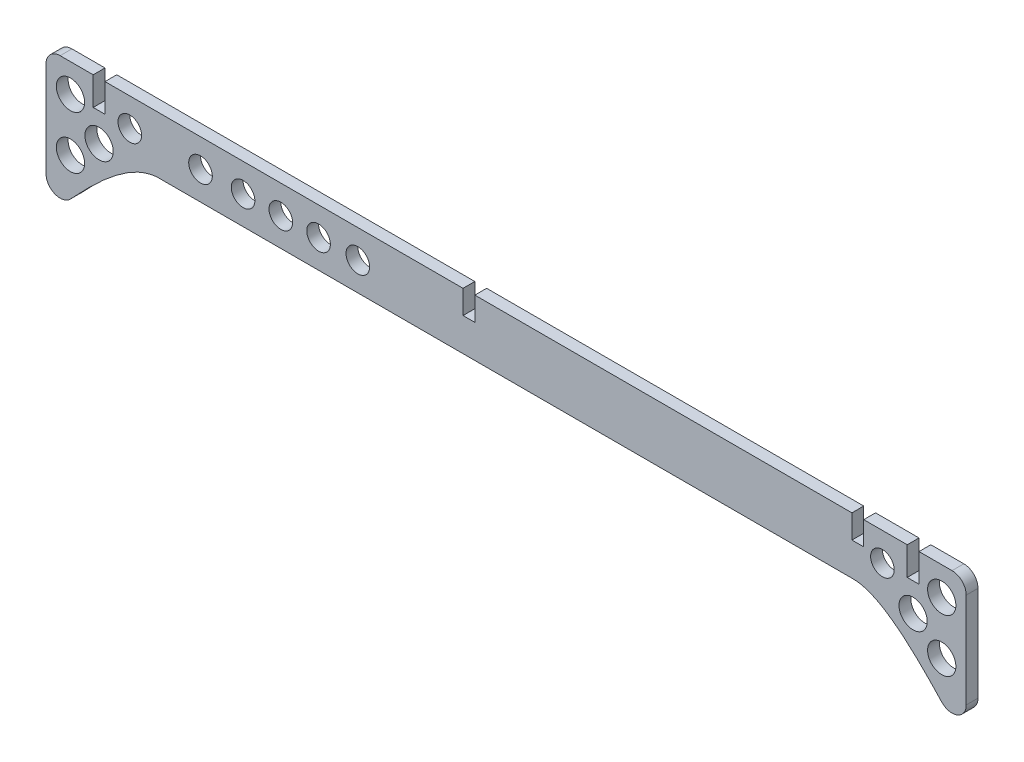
ISO-10303-21;
HEADER;
FILE_DESCRIPTION(('STEP AP214'),'2;1');
FILE_NAME('part.step','',(''),(''),'','','');
FILE_SCHEMA(('AUTOMOTIVE_DESIGN { 1 0 10303 214 1 1 1 1 }'));
ENDSEC;
DATA;
#1=APPLICATION_CONTEXT('core data for automotive mechanical design processes');
#2=APPLICATION_PROTOCOL_DEFINITION('international standard','automotive_design',2000,#1);
#3=PRODUCT_CONTEXT('',#1,'mechanical');
#4=PRODUCT('Part','Part','',(#3));
#5=PRODUCT_RELATED_PRODUCT_CATEGORY('part','',(#4));
#6=PRODUCT_DEFINITION_FORMATION('','',#4);
#7=PRODUCT_DEFINITION_CONTEXT('part definition',#1,'design');
#8=PRODUCT_DEFINITION('design','',#6,#7);
#9=PRODUCT_DEFINITION_SHAPE('','',#8);
#10=(LENGTH_UNIT() NAMED_UNIT(*) SI_UNIT(.MILLI.,.METRE.));
#11=(NAMED_UNIT(*) PLANE_ANGLE_UNIT() SI_UNIT($,.RADIAN.));
#12=(NAMED_UNIT(*) SI_UNIT($,.STERADIAN.) SOLID_ANGLE_UNIT());
#13=UNCERTAINTY_MEASURE_WITH_UNIT(LENGTH_MEASURE(1.E-05),#10,'distance_accuracy_value','');
#14=(GEOMETRIC_REPRESENTATION_CONTEXT(3) GLOBAL_UNCERTAINTY_ASSIGNED_CONTEXT((#13)) GLOBAL_UNIT_ASSIGNED_CONTEXT((#10,
#11,#12)) REPRESENTATION_CONTEXT('',''));
#15=CARTESIAN_POINT('',(0.,0.,0.));
#16=DIRECTION('',(0.,0.,1.));
#17=DIRECTION('',(1.,0.,0.));
#18=AXIS2_PLACEMENT_3D('',#15,#16,#17);
#19=CARTESIAN_POINT('',(-120.015,-21.7846997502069,3.175));
#20=DIRECTION('',(0.,0.,1.));
#21=DIRECTION('',(1.,0.,0.));
#22=AXIS2_PLACEMENT_3D('',#19,#20,#21);
#23=PLANE('',#22);
#24=CARTESIAN_POINT('',(117.239990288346,-14.2125382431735,3.175));
#25=DIRECTION('',(0.,0.,1.));
#26=DIRECTION('',(-1.,0.,0.));
#27=AXIS2_PLACEMENT_3D('',#24,#25,#26);
#28=CIRCLE('',#27,3.81);
#29=CARTESIAN_POINT('',(113.429990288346,-14.2125382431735,3.175));
#30=VERTEX_POINT('',#29);
#31=EDGE_CURVE('E485',#30,#30,#28,.T.);
#32=ORIENTED_EDGE('',*,*,#31,.F.);
#33=EDGE_LOOP('',(#32));
#34=FACE_BOUND('',#33,.T.);
#35=CARTESIAN_POINT('',(-109.5375,-7.62000000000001,3.175));
#36=DIRECTION('',(0.,0.,1.));
#37=DIRECTION('',(1.,0.,0.));
#38=AXIS2_PLACEMENT_3D('',#35,#36,#37);
#39=CIRCLE('',#38,3.81);
#40=CARTESIAN_POINT('',(-105.7275,-7.62000000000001,3.175));
#41=VERTEX_POINT('',#40);
#42=EDGE_CURVE('E473',#41,#41,#39,.T.);
#43=ORIENTED_EDGE('',*,*,#42,.F.);
#44=EDGE_LOOP('',(#43));
#45=FACE_BOUND('',#44,.T.);
#46=CARTESIAN_POINT('',(101.271287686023,-8.05059256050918E-12,3.175));
#47=DIRECTION('',(0.,0.,1.));
#48=DIRECTION('',(-1.,0.,0.));
#49=AXIS2_PLACEMENT_3D('',#46,#47,#48);
#50=CIRCLE('',#49,3.175);
#51=CARTESIAN_POINT('',(98.0962876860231,-8.05059256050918E-12,3.175));
#52=VERTEX_POINT('',#51);
#53=EDGE_CURVE('E461',#52,#52,#50,.T.);
#54=ORIENTED_EDGE('',*,*,#53,.F.);
#55=EDGE_LOOP('',(#54));
#56=FACE_BOUND('',#55,.T.);
#57=CARTESIAN_POINT('',(-50.4712876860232,-8.07539687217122E-12,3.175));
#58=DIRECTION('',(0.,0.,1.));
#59=DIRECTION('',(1.,0.,0.));
#60=AXIS2_PLACEMENT_3D('',#57,#58,#59);
#61=CIRCLE('',#60,3.175);
#62=CARTESIAN_POINT('',(-47.2962876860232,-8.07539687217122E-12,3.175));
#63=VERTEX_POINT('',#62);
#64=EDGE_CURVE('E449',#63,#63,#61,.T.);
#65=ORIENTED_EDGE('',*,*,#64,.F.);
#66=EDGE_LOOP('',(#65));
#67=FACE_BOUND('',#66,.T.);
#68=CARTESIAN_POINT('',(-70.7912876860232,-8.07539687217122E-12,3.175));
#69=DIRECTION('',(0.,0.,1.));
#70=DIRECTION('',(1.,0.,0.));
#71=AXIS2_PLACEMENT_3D('',#68,#69,#70);
#72=CIRCLE('',#71,3.175);
#73=CARTESIAN_POINT('',(-67.6162876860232,-8.07539687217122E-12,3.175));
#74=VERTEX_POINT('',#73);
#75=EDGE_CURVE('E437',#74,#74,#72,.T.);
#76=ORIENTED_EDGE('',*,*,#75,.F.);
#77=EDGE_LOOP('',(#76));
#78=FACE_BOUND('',#77,.T.);
#79=CARTESIAN_POINT('',(-101.271287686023,-8.07539687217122E-12,3.175));
#80=DIRECTION('',(0.,0.,1.));
#81=DIRECTION('',(1.,0.,0.));
#82=AXIS2_PLACEMENT_3D('',#79,#80,#81);
#83=CIRCLE('',#82,3.175);
#84=CARTESIAN_POINT('',(-98.0962876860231,-8.07539687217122E-12,3.175));
#85=VERTEX_POINT('',#84);
#86=EDGE_CURVE('E425',#85,#85,#83,.T.);
#87=ORIENTED_EDGE('',*,*,#86,.F.);
#88=EDGE_LOOP('',(#87));
#89=FACE_BOUND('',#88,.T.);
#90=DIRECTION('',(0.,-1.,0.));
#91=VECTOR('',#90,1.);
#92=CARTESIAN_POINT('',(-123.825,0.,3.175));
#93=LINE('',#92,#91);
#94=CARTESIAN_POINT('',(-123.825,3.80999999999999,3.175));
#95=VERTEX_POINT('',#94);
#96=CARTESIAN_POINT('',(-123.825,-21.7846997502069,3.175));
#97=VERTEX_POINT('',#96);
#98=EDGE_CURVE('E50',#95,#97,#93,.T.);
#99=ORIENTED_EDGE('',*,*,#98,.T.);
#100=CARTESIAN_POINT('',(-120.015,-21.7846997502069,3.175));
#101=DIRECTION('',(0.,0.,1.));
#102=DIRECTION('',(1.,0.,0.));
#103=AXIS2_PLACEMENT_3D('',#100,#101,#102);
#104=CIRCLE('',#103,3.80999999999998);
#105=CARTESIAN_POINT('',(-117.239990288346,-24.3953358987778,3.175));
#106=VERTEX_POINT('',#105);
#107=EDGE_CURVE('E148',#97,#106,#104,.T.);
#108=ORIENTED_EDGE('',*,*,#107,.T.);
#109=CARTESIAN_POINT('',(-117.239990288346,-24.3953358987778,3.175));
#110=CARTESIAN_POINT('',(-110.980979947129,-17.7422392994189,3.175));
#111=CARTESIAN_POINT('',(-101.376457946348,-7.66034233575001,3.175));
#112=CARTESIAN_POINT('',(-93.469360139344,-7.62000000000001,3.175));
#113=B_SPLINE_CURVE_WITH_KNOTS('',3,(#109,#110,#111,#112),.UNSPECIFIED.,.F.,.F.,(4,4),
(0.386367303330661,1.),.UNSPECIFIED.);
#114=CARTESIAN_POINT('',(-93.469360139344,-7.62000000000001,3.175));
#115=VERTEX_POINT('',#114);
#116=EDGE_CURVE('E372',#106,#115,#113,.T.);
#117=ORIENTED_EDGE('',*,*,#116,.T.);
#118=DIRECTION('',(1.,0.,0.));
#119=VECTOR('',#118,1.);
#120=CARTESIAN_POINT('',(93.469360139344,-7.62000000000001,3.175));
#121=LINE('',#120,#119);
#122=CARTESIAN_POINT('',(93.469360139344,-7.62000000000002,3.175));
#123=VERTEX_POINT('',#122);
#124=EDGE_CURVE('E392',#115,#123,#121,.T.);
#125=ORIENTED_EDGE('',*,*,#124,.T.);
#126=CARTESIAN_POINT('',(93.469360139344,-7.62000000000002,3.175));
#127=CARTESIAN_POINT('',(101.376457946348,-7.66034233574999,3.175));
#128=CARTESIAN_POINT('',(110.980979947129,-17.7422392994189,3.175));
#129=CARTESIAN_POINT('',(117.239990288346,-24.3953358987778,3.175));
#130=B_SPLINE_CURVE_WITH_KNOTS('',3,(#126,#127,#128,#129),.UNSPECIFIED.,.F.,.F.,(4,4),
(0.386367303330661,1.),.UNSPECIFIED.);
#131=CARTESIAN_POINT('',(117.239990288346,-24.3953358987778,3.175));
#132=VERTEX_POINT('',#131);
#133=EDGE_CURVE('E389',#123,#132,#130,.T.);
#134=ORIENTED_EDGE('',*,*,#133,.T.);
#135=CARTESIAN_POINT('',(120.015,-21.7846997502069,3.175));
#136=DIRECTION('',(0.,0.,1.));
#137=DIRECTION('',(-1.,0.,0.));
#138=AXIS2_PLACEMENT_3D('',#135,#136,#137);
#139=CIRCLE('',#138,3.80999999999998);
#140=CARTESIAN_POINT('',(123.825,-21.7846997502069,3.175));
#141=VERTEX_POINT('',#140);
#142=EDGE_CURVE('E391',#132,#141,#139,.T.);
#143=ORIENTED_EDGE('',*,*,#142,.T.);
#144=DIRECTION('',(0.,1.,0.));
#145=VECTOR('',#144,1.);
#146=CARTESIAN_POINT('',(123.825,0.,3.175));
#147=LINE('',#146,#145);
#148=CARTESIAN_POINT('',(123.825,3.80999999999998,3.175));
#149=VERTEX_POINT('',#148);
#150=EDGE_CURVE('E394',#141,#149,#147,.T.);
#151=ORIENTED_EDGE('',*,*,#150,.T.);
#152=CARTESIAN_POINT('',(120.015,3.80999999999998,3.175));
#153=DIRECTION('',(0.,0.,1.));
#154=DIRECTION('',(1.,0.,0.));
#155=AXIS2_PLACEMENT_3D('',#152,#153,#154);
#156=CIRCLE('',#155,3.81);
#157=CARTESIAN_POINT('',(120.015,7.61999999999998,3.175));
#158=VERTEX_POINT('',#157);
#159=EDGE_CURVE('E603',#149,#158,#156,.T.);
#160=ORIENTED_EDGE('',*,*,#159,.T.);
#161=DIRECTION('',(-1.,0.,0.));
#162=VECTOR('',#161,1.);
#163=CARTESIAN_POINT('',(111.125,7.61999999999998,3.175));
#164=LINE('',#163,#162);
#165=CARTESIAN_POINT('',(111.125,7.61999999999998,3.175));
#166=VERTEX_POINT('',#165);
#167=EDGE_CURVE('E614',#158,#166,#164,.T.);
#168=ORIENTED_EDGE('',*,*,#167,.T.);
#169=DIRECTION('',(0.,-1.,0.));
#170=VECTOR('',#169,1.);
#171=CARTESIAN_POINT('',(111.125,7.61999999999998,3.175));
#172=LINE('',#171,#170);
#173=CARTESIAN_POINT('',(111.125,0.,3.175));
#174=VERTEX_POINT('',#173);
#175=EDGE_CURVE('E611',#166,#174,#172,.T.);
#176=ORIENTED_EDGE('',*,*,#175,.T.);
#177=DIRECTION('',(-1.,0.,0.));
#178=VECTOR('',#177,1.);
#179=CARTESIAN_POINT('',(107.95,0.,3.175));
#180=LINE('',#179,#178);
#181=CARTESIAN_POINT('',(107.95,0.,3.175));
#182=VERTEX_POINT('',#181);
#183=EDGE_CURVE('E613',#174,#182,#180,.T.);
#184=ORIENTED_EDGE('',*,*,#183,.T.);
#185=DIRECTION('',(0.,1.,0.));
#186=VECTOR('',#185,1.);
#187=CARTESIAN_POINT('',(107.95,7.61999999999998,3.175));
#188=LINE('',#187,#186);
#189=CARTESIAN_POINT('',(107.95,7.61999999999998,3.175));
#190=VERTEX_POINT('',#189);
#191=EDGE_CURVE('E616',#182,#190,#188,.T.);
#192=ORIENTED_EDGE('',*,*,#191,.T.);
#193=DIRECTION('',(-1.,0.,0.));
#194=VECTOR('',#193,1.);
#195=CARTESIAN_POINT('',(107.95,7.61999999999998,3.175));
#196=LINE('',#195,#194);
#197=CARTESIAN_POINT('',(96.2480587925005,7.61999999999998,3.175));
#198=VERTEX_POINT('',#197);
#199=EDGE_CURVE('E622',#190,#198,#196,.T.);
#200=ORIENTED_EDGE('',*,*,#199,.T.);
#201=DIRECTION('',(0.,-1.,0.));
#202=VECTOR('',#201,1.);
#203=CARTESIAN_POINT('',(96.2480587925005,7.61999999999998,3.175));
#204=LINE('',#203,#202);
#205=CARTESIAN_POINT('',(96.2480587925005,1.26999999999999,3.175));
#206=VERTEX_POINT('',#205);
#207=EDGE_CURVE('E624',#198,#206,#204,.T.);
#208=ORIENTED_EDGE('',*,*,#207,.T.);
#209=DIRECTION('',(-1.,0.,0.));
#210=VECTOR('',#209,1.);
#211=CARTESIAN_POINT('',(93.0730587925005,1.26999999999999,3.175));
#212=LINE('',#211,#210);
#213=CARTESIAN_POINT('',(93.0730587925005,1.26999999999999,3.175));
#214=VERTEX_POINT('',#213);
#215=EDGE_CURVE('E626',#206,#214,#212,.T.);
#216=ORIENTED_EDGE('',*,*,#215,.T.);
#217=DIRECTION('',(0.,1.,0.));
#218=VECTOR('',#217,1.);
#219=CARTESIAN_POINT('',(93.0730587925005,7.61999999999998,3.175));
#220=LINE('',#219,#218);
#221=CARTESIAN_POINT('',(93.0730587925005,7.61999999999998,3.175));
#222=VERTEX_POINT('',#221);
#223=EDGE_CURVE('E628',#214,#222,#220,.T.);
#224=ORIENTED_EDGE('',*,*,#223,.T.);
#225=DIRECTION('',(-1.,0.,0.));
#226=VECTOR('',#225,1.);
#227=CARTESIAN_POINT('',(93.0730587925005,7.61999999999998,3.175));
#228=LINE('',#227,#226);
#229=CARTESIAN_POINT('',(-8.41485879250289,7.61999999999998,3.175));
#230=VERTEX_POINT('',#229);
#231=EDGE_CURVE('E630',#222,#230,#228,.T.);
#232=ORIENTED_EDGE('',*,*,#231,.T.);
#233=DIRECTION('',(0.,-1.,0.));
#234=VECTOR('',#233,1.);
#235=CARTESIAN_POINT('',(-8.41485879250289,7.61999999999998,3.175));
#236=LINE('',#235,#234);
#237=CARTESIAN_POINT('',(-8.41485879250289,1.26999999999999,3.175));
#238=VERTEX_POINT('',#237);
#239=EDGE_CURVE('E632',#230,#238,#236,.T.);
#240=ORIENTED_EDGE('',*,*,#239,.T.);
#241=DIRECTION('',(-1.,0.,0.));
#242=VECTOR('',#241,1.);
#243=CARTESIAN_POINT('',(-8.41485879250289,1.26999999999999,3.175));
#244=LINE('',#243,#242);
#245=CARTESIAN_POINT('',(-11.5898587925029,1.26999999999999,3.175));
#246=VERTEX_POINT('',#245);
#247=EDGE_CURVE('E634',#238,#246,#244,.T.);
#248=ORIENTED_EDGE('',*,*,#247,.T.);
#249=DIRECTION('',(0.,1.,0.));
#250=VECTOR('',#249,1.);
#251=CARTESIAN_POINT('',(-11.5898587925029,7.61999999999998,3.175));
#252=LINE('',#251,#250);
#253=CARTESIAN_POINT('',(-11.5898587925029,7.61999999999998,3.175));
#254=VERTEX_POINT('',#253);
#255=EDGE_CURVE('E636',#246,#254,#252,.T.);
#256=ORIENTED_EDGE('',*,*,#255,.T.);
#257=DIRECTION('',(-1.,0.,0.));
#258=VECTOR('',#257,1.);
#259=CARTESIAN_POINT('',(-11.5898587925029,7.61999999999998,3.175));
#260=LINE('',#259,#258);
#261=CARTESIAN_POINT('',(-107.95,7.61999999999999,3.175));
#262=VERTEX_POINT('',#261);
#263=EDGE_CURVE('E638',#254,#262,#260,.T.);
#264=ORIENTED_EDGE('',*,*,#263,.T.);
#265=DIRECTION('',(0.,-1.,0.));
#266=VECTOR('',#265,1.);
#267=CARTESIAN_POINT('',(-107.95,7.61999999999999,3.175));
#268=LINE('',#267,#266);
#269=CARTESIAN_POINT('',(-107.95,0.,3.175));
#270=VERTEX_POINT('',#269);
#271=EDGE_CURVE('E640',#262,#270,#268,.T.);
#272=ORIENTED_EDGE('',*,*,#271,.T.);
#273=DIRECTION('',(-1.,0.,0.));
#274=VECTOR('',#273,1.);
#275=CARTESIAN_POINT('',(-107.95,0.,3.175));
#276=LINE('',#275,#274);
#277=CARTESIAN_POINT('',(-111.125,0.,3.175));
#278=VERTEX_POINT('',#277);
#279=EDGE_CURVE('E222',#270,#278,#276,.T.);
#280=ORIENTED_EDGE('',*,*,#279,.T.);
#281=DIRECTION('',(0.,1.,0.));
#282=VECTOR('',#281,1.);
#283=CARTESIAN_POINT('',(-111.125,7.61999999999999,3.175));
#284=LINE('',#283,#282);
#285=CARTESIAN_POINT('',(-111.125,7.61999999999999,3.175));
#286=VERTEX_POINT('',#285);
#287=EDGE_CURVE('E216',#278,#286,#284,.T.);
#288=ORIENTED_EDGE('',*,*,#287,.T.);
#289=DIRECTION('',(-1.,0.,0.));
#290=VECTOR('',#289,1.);
#291=CARTESIAN_POINT('',(-111.125,7.61999999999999,3.175));
#292=LINE('',#291,#290);
#293=CARTESIAN_POINT('',(-120.015,7.61999999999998,3.175));
#294=VERTEX_POINT('',#293);
#295=EDGE_CURVE('E220',#286,#294,#292,.T.);
#296=ORIENTED_EDGE('',*,*,#295,.T.);
#297=CARTESIAN_POINT('',(-120.015,3.80999999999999,3.175));
#298=DIRECTION('',(0.,0.,1.));
#299=DIRECTION('',(-1.,0.,0.));
#300=AXIS2_PLACEMENT_3D('',#297,#298,#299);
#301=CIRCLE('',#300,3.81);
#302=EDGE_CURVE('E236',#294,#95,#301,.T.);
#303=ORIENTED_EDGE('',*,*,#302,.T.);
#304=EDGE_LOOP('',(#99,#108,#117,#125,#134,#143,#151,#160,#168,#176,#184,#192,#200,#208,#216,
#224,#232,#240,#248,#256,#264,#272,#280,#288,#296,#303));
#305=FACE_BOUND('',#304,.T.);
#306=CARTESIAN_POINT('',(-117.239990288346,0.,3.175));
#307=DIRECTION('',(0.,0.,1.));
#308=DIRECTION('',(1.,0.,0.));
#309=AXIS2_PLACEMENT_3D('',#306,#307,#308);
#310=CIRCLE('',#309,3.81);
#311=CARTESIAN_POINT('',(-113.429990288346,0.,3.175));
#312=VERTEX_POINT('',#311);
#313=EDGE_CURVE('E245',#312,#312,#310,.T.);
#314=ORIENTED_EDGE('',*,*,#313,.F.);
#315=EDGE_LOOP('',(#314));
#316=FACE_BOUND('',#315,.T.);
#317=CARTESIAN_POINT('',(-82.2415584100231,-8.07539687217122E-12,3.175));
#318=DIRECTION('',(0.,0.,1.));
#319=DIRECTION('',(1.,0.,0.));
#320=AXIS2_PLACEMENT_3D('',#317,#318,#319);
#321=CIRCLE('',#320,3.175);
#322=CARTESIAN_POINT('',(-79.0665584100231,-8.07539687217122E-12,3.175));
#323=VERTEX_POINT('',#322);
#324=EDGE_CURVE('E431',#323,#323,#321,.T.);
#325=ORIENTED_EDGE('',*,*,#324,.F.);
#326=EDGE_LOOP('',(#325));
#327=FACE_BOUND('',#326,.T.);
#328=CARTESIAN_POINT('',(-60.6312876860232,-8.07539687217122E-12,3.175));
#329=DIRECTION('',(0.,0.,1.));
#330=DIRECTION('',(1.,0.,0.));
#331=AXIS2_PLACEMENT_3D('',#328,#329,#330);
#332=CIRCLE('',#331,3.175);
#333=CARTESIAN_POINT('',(-57.4562876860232,-8.07539687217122E-12,3.175));
#334=VERTEX_POINT('',#333);
#335=EDGE_CURVE('E443',#334,#334,#332,.T.);
#336=ORIENTED_EDGE('',*,*,#335,.F.);
#337=EDGE_LOOP('',(#336));
#338=FACE_BOUND('',#337,.T.);
#339=CARTESIAN_POINT('',(-39.9082252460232,-8.07539687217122E-12,3.175));
#340=DIRECTION('',(0.,0.,1.));
#341=DIRECTION('',(1.,0.,0.));
#342=AXIS2_PLACEMENT_3D('',#339,#340,#341);
#343=CIRCLE('',#342,3.17500000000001);
#344=CARTESIAN_POINT('',(-36.7332252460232,-8.07539687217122E-12,3.175));
#345=VERTEX_POINT('',#344);
#346=EDGE_CURVE('E455',#345,#345,#343,.T.);
#347=ORIENTED_EDGE('',*,*,#346,.F.);
#348=EDGE_LOOP('',(#347));
#349=FACE_BOUND('',#348,.T.);
#350=CARTESIAN_POINT('',(117.239990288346,0.,3.175));
#351=DIRECTION('',(0.,0.,1.));
#352=DIRECTION('',(-1.,0.,0.));
#353=AXIS2_PLACEMENT_3D('',#350,#351,#352);
#354=CIRCLE('',#353,3.81);
#355=CARTESIAN_POINT('',(113.429990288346,0.,3.175));
#356=VERTEX_POINT('',#355);
#357=EDGE_CURVE('E467',#356,#356,#354,.T.);
#358=ORIENTED_EDGE('',*,*,#357,.F.);
#359=EDGE_LOOP('',(#358));
#360=FACE_BOUND('',#359,.T.);
#361=CARTESIAN_POINT('',(-117.239990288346,-14.2125382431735,3.175));
#362=DIRECTION('',(0.,0.,1.));
#363=DIRECTION('',(1.,0.,0.));
#364=AXIS2_PLACEMENT_3D('',#361,#362,#363);
#365=CIRCLE('',#364,3.81);
#366=CARTESIAN_POINT('',(-113.429990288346,-14.2125382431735,3.175));
#367=VERTEX_POINT('',#366);
#368=EDGE_CURVE('E479',#367,#367,#365,.T.);
#369=ORIENTED_EDGE('',*,*,#368,.F.);
#370=EDGE_LOOP('',(#369));
#371=FACE_BOUND('',#370,.T.);
#372=CARTESIAN_POINT('',(109.5375,-7.62000000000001,3.175));
#373=DIRECTION('',(0.,0.,1.));
#374=DIRECTION('',(-1.,0.,0.));
#375=AXIS2_PLACEMENT_3D('',#372,#373,#374);
#376=CIRCLE('',#375,3.81);
#377=CARTESIAN_POINT('',(105.7275,-7.62000000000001,3.175));
#378=VERTEX_POINT('',#377);
#379=EDGE_CURVE('E491',#378,#378,#376,.T.);
#380=ORIENTED_EDGE('',*,*,#379,.F.);
#381=EDGE_LOOP('',(#380));
#382=FACE_BOUND('',#381,.T.);
#383=ADVANCED_FACE('F33',(#34,#45,#56,#67,#78,#89,#305,#316,#327,#338,#349,#360,#371,#382),#23,.T.);
#384=CARTESIAN_POINT('',(-120.015,-21.7846997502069,0.));
#385=DIRECTION('',(0.,0.,1.));
#386=DIRECTION('',(1.,0.,0.));
#387=AXIS2_PLACEMENT_3D('',#384,#385,#386);
#388=PLANE('',#387);
#389=CARTESIAN_POINT('',(117.239990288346,-14.2125382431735,0.));
#390=DIRECTION('',(0.,0.,1.));
#391=DIRECTION('',(-1.,0.,0.));
#392=AXIS2_PLACEMENT_3D('',#389,#390,#391);
#393=CIRCLE('',#392,3.81);
#394=CARTESIAN_POINT('',(113.429990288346,-14.2125382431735,0.));
#395=VERTEX_POINT('',#394);
#396=EDGE_CURVE('E488',#395,#395,#393,.T.);
#397=ORIENTED_EDGE('',*,*,#396,.T.);
#398=EDGE_LOOP('',(#397));
#399=FACE_BOUND('',#398,.T.);
#400=CARTESIAN_POINT('',(-109.5375,-7.62000000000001,0.));
#401=DIRECTION('',(0.,0.,1.));
#402=DIRECTION('',(1.,0.,0.));
#403=AXIS2_PLACEMENT_3D('',#400,#401,#402);
#404=CIRCLE('',#403,3.81);
#405=CARTESIAN_POINT('',(-105.7275,-7.62000000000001,0.));
#406=VERTEX_POINT('',#405);
#407=EDGE_CURVE('E476',#406,#406,#404,.T.);
#408=ORIENTED_EDGE('',*,*,#407,.T.);
#409=EDGE_LOOP('',(#408));
#410=FACE_BOUND('',#409,.T.);
#411=CARTESIAN_POINT('',(101.271287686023,-8.05059256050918E-12,0.));
#412=DIRECTION('',(0.,0.,1.));
#413=DIRECTION('',(-1.,0.,0.));
#414=AXIS2_PLACEMENT_3D('',#411,#412,#413);
#415=CIRCLE('',#414,3.175);
#416=CARTESIAN_POINT('',(98.0962876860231,-8.05059256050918E-12,0.));
#417=VERTEX_POINT('',#416);
#418=EDGE_CURVE('E464',#417,#417,#415,.T.);
#419=ORIENTED_EDGE('',*,*,#418,.T.);
#420=EDGE_LOOP('',(#419));
#421=FACE_BOUND('',#420,.T.);
#422=CARTESIAN_POINT('',(-50.4712876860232,-8.07539687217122E-12,0.));
#423=DIRECTION('',(0.,0.,1.));
#424=DIRECTION('',(1.,0.,0.));
#425=AXIS2_PLACEMENT_3D('',#422,#423,#424);
#426=CIRCLE('',#425,3.175);
#427=CARTESIAN_POINT('',(-47.2962876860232,-8.07539687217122E-12,0.));
#428=VERTEX_POINT('',#427);
#429=EDGE_CURVE('E452',#428,#428,#426,.T.);
#430=ORIENTED_EDGE('',*,*,#429,.T.);
#431=EDGE_LOOP('',(#430));
#432=FACE_BOUND('',#431,.T.);
#433=CARTESIAN_POINT('',(-70.7912876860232,-8.07539687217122E-12,0.));
#434=DIRECTION('',(0.,0.,1.));
#435=DIRECTION('',(1.,0.,0.));
#436=AXIS2_PLACEMENT_3D('',#433,#434,#435);
#437=CIRCLE('',#436,3.175);
#438=CARTESIAN_POINT('',(-67.6162876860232,-8.07539687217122E-12,0.));
#439=VERTEX_POINT('',#438);
#440=EDGE_CURVE('E440',#439,#439,#437,.T.);
#441=ORIENTED_EDGE('',*,*,#440,.T.);
#442=EDGE_LOOP('',(#441));
#443=FACE_BOUND('',#442,.T.);
#444=CARTESIAN_POINT('',(-101.271287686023,-8.07539687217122E-12,0.));
#445=DIRECTION('',(0.,0.,1.));
#446=DIRECTION('',(1.,0.,0.));
#447=AXIS2_PLACEMENT_3D('',#444,#445,#446);
#448=CIRCLE('',#447,3.175);
#449=CARTESIAN_POINT('',(-98.0962876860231,-8.07539687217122E-12,0.));
#450=VERTEX_POINT('',#449);
#451=EDGE_CURVE('E428',#450,#450,#448,.T.);
#452=ORIENTED_EDGE('',*,*,#451,.T.);
#453=EDGE_LOOP('',(#452));
#454=FACE_BOUND('',#453,.T.);
#455=CARTESIAN_POINT('',(-120.015,-21.7846997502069,0.));
#456=DIRECTION('',(0.,0.,1.));
#457=DIRECTION('',(1.,0.,0.));
#458=AXIS2_PLACEMENT_3D('',#455,#456,#457);
#459=CIRCLE('',#458,3.80999999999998);
#460=CARTESIAN_POINT('',(-123.825,-21.7846997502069,0.));
#461=VERTEX_POINT('',#460);
#462=CARTESIAN_POINT('',(-117.239990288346,-24.3953358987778,0.));
#463=VERTEX_POINT('',#462);
#464=EDGE_CURVE('E242',#461,#463,#459,.T.);
#465=ORIENTED_EDGE('',*,*,#464,.F.);
#466=DIRECTION('',(0.,-1.,0.));
#467=VECTOR('',#466,1.);
#468=CARTESIAN_POINT('',(-123.825,0.,0.));
#469=LINE('',#468,#467);
#470=CARTESIAN_POINT('',(-123.825,3.80999999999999,0.));
#471=VERTEX_POINT('',#470);
#472=EDGE_CURVE('E302',#471,#461,#469,.T.);
#473=ORIENTED_EDGE('',*,*,#472,.F.);
#474=CARTESIAN_POINT('',(-120.015,3.80999999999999,0.));
#475=DIRECTION('',(0.,0.,1.));
#476=DIRECTION('',(-1.,0.,0.));
#477=AXIS2_PLACEMENT_3D('',#474,#475,#476);
#478=CIRCLE('',#477,3.81);
#479=CARTESIAN_POINT('',(-120.015,7.61999999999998,0.));
#480=VERTEX_POINT('',#479);
#481=EDGE_CURVE('E141',#480,#471,#478,.T.);
#482=ORIENTED_EDGE('',*,*,#481,.F.);
#483=DIRECTION('',(-1.,0.,0.));
#484=VECTOR('',#483,1.);
#485=CARTESIAN_POINT('',(-111.125,7.61999999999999,0.));
#486=LINE('',#485,#484);
#487=CARTESIAN_POINT('',(-111.125,7.61999999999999,0.));
#488=VERTEX_POINT('',#487);
#489=EDGE_CURVE('E134',#488,#480,#486,.T.);
#490=ORIENTED_EDGE('',*,*,#489,.F.);
#491=DIRECTION('',(0.,1.,0.));
#492=VECTOR('',#491,1.);
#493=CARTESIAN_POINT('',(-111.125,7.61999999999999,0.));
#494=LINE('',#493,#492);
#495=CARTESIAN_POINT('',(-111.125,0.,0.));
#496=VERTEX_POINT('',#495);
#497=EDGE_CURVE('E230',#496,#488,#494,.T.);
#498=ORIENTED_EDGE('',*,*,#497,.F.);
#499=DIRECTION('',(-1.,0.,0.));
#500=VECTOR('',#499,1.);
#501=CARTESIAN_POINT('',(-107.95,0.,0.));
#502=LINE('',#501,#500);
#503=CARTESIAN_POINT('',(-107.95,0.,0.));
#504=VERTEX_POINT('',#503);
#505=EDGE_CURVE('E297',#504,#496,#502,.T.);
#506=ORIENTED_EDGE('',*,*,#505,.F.);
#507=DIRECTION('',(0.,-1.,0.));
#508=VECTOR('',#507,1.);
#509=CARTESIAN_POINT('',(-107.95,7.61999999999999,0.));
#510=LINE('',#509,#508);
#511=CARTESIAN_POINT('',(-107.95,7.61999999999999,0.));
#512=VERTEX_POINT('',#511);
#513=EDGE_CURVE('E295',#512,#504,#510,.T.);
#514=ORIENTED_EDGE('',*,*,#513,.F.);
#515=DIRECTION('',(-1.,0.,0.));
#516=VECTOR('',#515,1.);
#517=CARTESIAN_POINT('',(-47.931287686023,7.61999999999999,0.));
#518=LINE('',#517,#516);
#519=CARTESIAN_POINT('',(-11.5898587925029,7.61999999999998,0.));
#520=VERTEX_POINT('',#519);
#521=EDGE_CURVE('E293',#520,#512,#518,.T.);
#522=ORIENTED_EDGE('',*,*,#521,.F.);
#523=DIRECTION('',(0.,1.,0.));
#524=VECTOR('',#523,1.);
#525=CARTESIAN_POINT('',(-11.5898587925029,7.61999999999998,0.));
#526=LINE('',#525,#524);
#527=CARTESIAN_POINT('',(-11.5898587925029,1.26999999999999,0.));
#528=VERTEX_POINT('',#527);
#529=EDGE_CURVE('E290',#528,#520,#526,.T.);
#530=ORIENTED_EDGE('',*,*,#529,.F.);
#531=DIRECTION('',(-1.,0.,0.));
#532=VECTOR('',#531,1.);
#533=CARTESIAN_POINT('',(-8.41485879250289,1.26999999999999,0.));
#534=LINE('',#533,#532);
#535=CARTESIAN_POINT('',(-8.41485879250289,1.26999999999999,0.));
#536=VERTEX_POINT('',#535);
#537=EDGE_CURVE('E288',#536,#528,#534,.T.);
#538=ORIENTED_EDGE('',*,*,#537,.F.);
#539=DIRECTION('',(0.,-1.,0.));
#540=VECTOR('',#539,1.);
#541=CARTESIAN_POINT('',(-8.41485879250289,7.61999999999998,0.));
#542=LINE('',#541,#540);
#543=CARTESIAN_POINT('',(-8.41485879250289,7.61999999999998,0.));
#544=VERTEX_POINT('',#543);
#545=EDGE_CURVE('E286',#544,#536,#542,.T.);
#546=ORIENTED_EDGE('',*,*,#545,.F.);
#547=DIRECTION('',(-1.,0.,0.));
#548=VECTOR('',#547,1.);
#549=CARTESIAN_POINT('',(93.0730587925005,7.61999999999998,0.));
#550=LINE('',#549,#548);
#551=CARTESIAN_POINT('',(93.0730587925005,7.61999999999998,0.));
#552=VERTEX_POINT('',#551);
#553=EDGE_CURVE('E284',#552,#544,#550,.T.);
#554=ORIENTED_EDGE('',*,*,#553,.F.);
#555=DIRECTION('',(0.,1.,0.));
#556=VECTOR('',#555,1.);
#557=CARTESIAN_POINT('',(93.0730587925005,7.61999999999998,0.));
#558=LINE('',#557,#556);
#559=CARTESIAN_POINT('',(93.0730587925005,1.26999999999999,0.));
#560=VERTEX_POINT('',#559);
#561=EDGE_CURVE('E282',#560,#552,#558,.T.);
#562=ORIENTED_EDGE('',*,*,#561,.F.);
#563=DIRECTION('',(-1.,0.,0.));
#564=VECTOR('',#563,1.);
#565=CARTESIAN_POINT('',(93.0730587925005,1.26999999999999,0.));
#566=LINE('',#565,#564);
#567=CARTESIAN_POINT('',(96.2480587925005,1.26999999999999,0.));
#568=VERTEX_POINT('',#567);
#569=EDGE_CURVE('E280',#568,#560,#566,.T.);
#570=ORIENTED_EDGE('',*,*,#569,.F.);
#571=DIRECTION('',(0.,-1.,0.));
#572=VECTOR('',#571,1.);
#573=CARTESIAN_POINT('',(96.2480587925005,7.61999999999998,0.));
#574=LINE('',#573,#572);
#575=CARTESIAN_POINT('',(96.2480587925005,7.61999999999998,0.));
#576=VERTEX_POINT('',#575);
#577=EDGE_CURVE('E278',#576,#568,#574,.T.);
#578=ORIENTED_EDGE('',*,*,#577,.F.);
#579=DIRECTION('',(-1.,0.,0.));
#580=VECTOR('',#579,1.);
#581=CARTESIAN_POINT('',(107.95,7.61999999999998,0.));
#582=LINE('',#581,#580);
#583=CARTESIAN_POINT('',(107.95,7.61999999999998,0.));
#584=VERTEX_POINT('',#583);
#585=EDGE_CURVE('E276',#584,#576,#582,.T.);
#586=ORIENTED_EDGE('',*,*,#585,.F.);
#587=DIRECTION('',(0.,1.,0.));
#588=VECTOR('',#587,1.);
#589=CARTESIAN_POINT('',(107.95,7.61999999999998,0.));
#590=LINE('',#589,#588);
#591=CARTESIAN_POINT('',(107.95,0.,0.));
#592=VERTEX_POINT('',#591);
#593=EDGE_CURVE('E274',#592,#584,#590,.T.);
#594=ORIENTED_EDGE('',*,*,#593,.F.);
#595=DIRECTION('',(-1.,0.,0.));
#596=VECTOR('',#595,1.);
#597=CARTESIAN_POINT('',(107.95,0.,0.));
#598=LINE('',#597,#596);
#599=CARTESIAN_POINT('',(111.125,0.,0.));
#600=VERTEX_POINT('',#599);
#601=EDGE_CURVE('E272',#600,#592,#598,.T.);
#602=ORIENTED_EDGE('',*,*,#601,.F.);
#603=DIRECTION('',(0.,-1.,0.));
#604=VECTOR('',#603,1.);
#605=CARTESIAN_POINT('',(111.125,7.61999999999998,0.));
#606=LINE('',#605,#604);
#607=CARTESIAN_POINT('',(111.125,7.61999999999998,0.));
#608=VERTEX_POINT('',#607);
#609=EDGE_CURVE('E270',#608,#600,#606,.T.);
#610=ORIENTED_EDGE('',*,*,#609,.F.);
#611=DIRECTION('',(-1.,0.,0.));
#612=VECTOR('',#611,1.);
#613=CARTESIAN_POINT('',(111.125,7.61999999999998,0.));
#614=LINE('',#613,#612);
#615=CARTESIAN_POINT('',(120.015,7.61999999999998,0.));
#616=VERTEX_POINT('',#615);
#617=EDGE_CURVE('E268',#616,#608,#614,.T.);
#618=ORIENTED_EDGE('',*,*,#617,.F.);
#619=CARTESIAN_POINT('',(120.015,3.80999999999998,0.));
#620=DIRECTION('',(0.,0.,1.));
#621=DIRECTION('',(1.,0.,0.));
#622=AXIS2_PLACEMENT_3D('',#619,#620,#621);
#623=CIRCLE('',#622,3.81);
#624=CARTESIAN_POINT('',(123.825,3.80999999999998,0.));
#625=VERTEX_POINT('',#624);
#626=EDGE_CURVE('E266',#625,#616,#623,.T.);
#627=ORIENTED_EDGE('',*,*,#626,.F.);
#628=DIRECTION('',(0.,1.,0.));
#629=VECTOR('',#628,1.);
#630=CARTESIAN_POINT('',(123.825,0.,0.));
#631=LINE('',#630,#629);
#632=CARTESIAN_POINT('',(123.825,-21.7846997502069,0.));
#633=VERTEX_POINT('',#632);
#634=EDGE_CURVE('E264',#633,#625,#631,.T.);
#635=ORIENTED_EDGE('',*,*,#634,.F.);
#636=CARTESIAN_POINT('',(120.015,-21.7846997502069,0.));
#637=DIRECTION('',(0.,0.,1.));
#638=DIRECTION('',(-1.,0.,0.));
#639=AXIS2_PLACEMENT_3D('',#636,#637,#638);
#640=CIRCLE('',#639,3.80999999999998);
#641=CARTESIAN_POINT('',(117.239990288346,-24.3953358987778,0.));
#642=VERTEX_POINT('',#641);
#643=EDGE_CURVE('E258',#642,#633,#640,.T.);
#644=ORIENTED_EDGE('',*,*,#643,.F.);
#645=CARTESIAN_POINT('',(93.469360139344,-7.62000000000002,0.));
#646=CARTESIAN_POINT('',(101.376457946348,-7.66034233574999,0.));
#647=CARTESIAN_POINT('',(110.980979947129,-17.7422392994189,0.));
#648=CARTESIAN_POINT('',(117.239990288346,-24.3953358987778,0.));
#649=B_SPLINE_CURVE_WITH_KNOTS('',3,(#645,#646,#647,#648),.UNSPECIFIED.,.F.,.F.,(4,4),
(0.386367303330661,1.),.UNSPECIFIED.);
#650=CARTESIAN_POINT('',(93.469360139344,-7.62000000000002,0.));
#651=VERTEX_POINT('',#650);
#652=EDGE_CURVE('E254',#651,#642,#649,.T.);
#653=ORIENTED_EDGE('',*,*,#652,.F.);
#654=DIRECTION('',(1.,0.,0.));
#655=VECTOR('',#654,1.);
#656=CARTESIAN_POINT('',(93.469360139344,-7.62000000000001,0.));
#657=LINE('',#656,#655);
#658=CARTESIAN_POINT('',(-93.469360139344,-7.62000000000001,0.));
#659=VERTEX_POINT('',#658);
#660=EDGE_CURVE('E249',#659,#651,#657,.T.);
#661=ORIENTED_EDGE('',*,*,#660,.F.);
#662=CARTESIAN_POINT('',(-117.239990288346,-24.3953358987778,0.));
#663=CARTESIAN_POINT('',(-110.980979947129,-17.7422392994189,0.));
#664=CARTESIAN_POINT('',(-101.376457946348,-7.66034233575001,0.));
#665=CARTESIAN_POINT('',(-93.469360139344,-7.62000000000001,0.));
#666=B_SPLINE_CURVE_WITH_KNOTS('',3,(#662,#663,#664,#665),.UNSPECIFIED.,.F.,.F.,(4,4),
(0.386367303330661,1.),.UNSPECIFIED.);
#667=EDGE_CURVE('E244',#463,#659,#666,.T.);
#668=ORIENTED_EDGE('',*,*,#667,.F.);
#669=EDGE_LOOP('',(#465,#473,#482,#490,#498,#506,#514,#522,#530,#538,#546,#554,#562,#570,#578,
#586,#594,#602,#610,#618,#627,#635,#644,#653,#661,#668));
#670=FACE_BOUND('',#669,.T.);
#671=CARTESIAN_POINT('',(-117.239990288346,0.,0.));
#672=DIRECTION('',(0.,0.,1.));
#673=DIRECTION('',(1.,0.,0.));
#674=AXIS2_PLACEMENT_3D('',#671,#672,#673);
#675=CIRCLE('',#674,3.81);
#676=CARTESIAN_POINT('',(-113.429990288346,0.,0.));
#677=VERTEX_POINT('',#676);
#678=EDGE_CURVE('E422',#677,#677,#675,.T.);
#679=ORIENTED_EDGE('',*,*,#678,.T.);
#680=EDGE_LOOP('',(#679));
#681=FACE_BOUND('',#680,.T.);
#682=CARTESIAN_POINT('',(-82.2415584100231,-8.07539687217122E-12,0.));
#683=DIRECTION('',(0.,0.,1.));
#684=DIRECTION('',(1.,0.,0.));
#685=AXIS2_PLACEMENT_3D('',#682,#683,#684);
#686=CIRCLE('',#685,3.175);
#687=CARTESIAN_POINT('',(-79.0665584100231,-8.07539687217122E-12,0.));
#688=VERTEX_POINT('',#687);
#689=EDGE_CURVE('E434',#688,#688,#686,.T.);
#690=ORIENTED_EDGE('',*,*,#689,.T.);
#691=EDGE_LOOP('',(#690));
#692=FACE_BOUND('',#691,.T.);
#693=CARTESIAN_POINT('',(-60.6312876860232,-8.07539687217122E-12,0.));
#694=DIRECTION('',(0.,0.,1.));
#695=DIRECTION('',(1.,0.,0.));
#696=AXIS2_PLACEMENT_3D('',#693,#694,#695);
#697=CIRCLE('',#696,3.175);
#698=CARTESIAN_POINT('',(-57.4562876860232,-8.07539687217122E-12,0.));
#699=VERTEX_POINT('',#698);
#700=EDGE_CURVE('E446',#699,#699,#697,.T.);
#701=ORIENTED_EDGE('',*,*,#700,.T.);
#702=EDGE_LOOP('',(#701));
#703=FACE_BOUND('',#702,.T.);
#704=CARTESIAN_POINT('',(-39.9082252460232,-8.07539687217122E-12,0.));
#705=DIRECTION('',(0.,0.,1.));
#706=DIRECTION('',(1.,0.,0.));
#707=AXIS2_PLACEMENT_3D('',#704,#705,#706);
#708=CIRCLE('',#707,3.17500000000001);
#709=CARTESIAN_POINT('',(-36.7332252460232,-8.07539687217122E-12,0.));
#710=VERTEX_POINT('',#709);
#711=EDGE_CURVE('E458',#710,#710,#708,.T.);
#712=ORIENTED_EDGE('',*,*,#711,.T.);
#713=EDGE_LOOP('',(#712));
#714=FACE_BOUND('',#713,.T.);
#715=CARTESIAN_POINT('',(117.239990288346,0.,0.));
#716=DIRECTION('',(0.,0.,1.));
#717=DIRECTION('',(-1.,0.,0.));
#718=AXIS2_PLACEMENT_3D('',#715,#716,#717);
#719=CIRCLE('',#718,3.81);
#720=CARTESIAN_POINT('',(113.429990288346,0.,0.));
#721=VERTEX_POINT('',#720);
#722=EDGE_CURVE('E470',#721,#721,#719,.T.);
#723=ORIENTED_EDGE('',*,*,#722,.T.);
#724=EDGE_LOOP('',(#723));
#725=FACE_BOUND('',#724,.T.);
#726=CARTESIAN_POINT('',(-117.239990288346,-14.2125382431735,0.));
#727=DIRECTION('',(0.,0.,1.));
#728=DIRECTION('',(1.,0.,0.));
#729=AXIS2_PLACEMENT_3D('',#726,#727,#728);
#730=CIRCLE('',#729,3.81);
#731=CARTESIAN_POINT('',(-113.429990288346,-14.2125382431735,0.));
#732=VERTEX_POINT('',#731);
#733=EDGE_CURVE('E482',#732,#732,#730,.T.);
#734=ORIENTED_EDGE('',*,*,#733,.T.);
#735=EDGE_LOOP('',(#734));
#736=FACE_BOUND('',#735,.T.);
#737=CARTESIAN_POINT('',(109.5375,-7.62000000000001,0.));
#738=DIRECTION('',(0.,0.,1.));
#739=DIRECTION('',(-1.,0.,0.));
#740=AXIS2_PLACEMENT_3D('',#737,#738,#739);
#741=CIRCLE('',#740,3.81);
#742=CARTESIAN_POINT('',(105.7275,-7.62000000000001,0.));
#743=VERTEX_POINT('',#742);
#744=EDGE_CURVE('E494',#743,#743,#741,.T.);
#745=ORIENTED_EDGE('',*,*,#744,.T.);
#746=EDGE_LOOP('',(#745));
#747=FACE_BOUND('',#746,.T.);
#748=ADVANCED_FACE('F376',(#399,#410,#421,#432,#443,#454,#670,#681,#692,#703,#714,#725,#736,
#747),#388,.F.);
#749=CARTESIAN_POINT('',(-120.015,-21.7846997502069,3.175));
#750=DIRECTION('',(0.,0.,-1.));
#751=DIRECTION('',(-1.,0.,0.));
#752=AXIS2_PLACEMENT_3D('',#749,#750,#751);
#753=CYLINDRICAL_SURFACE('',#752,3.80999999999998);
#754=ORIENTED_EDGE('',*,*,#464,.T.);
#755=DIRECTION('',(0.,0.,-1.));
#756=VECTOR('',#755,1.);
#757=CARTESIAN_POINT('',(-117.239990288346,-24.3953358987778,3.175));
#758=LINE('',#757,#756);
#759=EDGE_CURVE('E42',#106,#463,#758,.T.);
#760=ORIENTED_EDGE('',*,*,#759,.F.);
#761=ORIENTED_EDGE('',*,*,#107,.F.);
#762=DIRECTION('',(0.,0.,-1.));
#763=VECTOR('',#762,1.);
#764=CARTESIAN_POINT('',(-123.825,-21.7846997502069,3.175));
#765=LINE('',#764,#763);
#766=EDGE_CURVE('E11',#97,#461,#765,.T.);
#767=ORIENTED_EDGE('',*,*,#766,.T.);
#768=EDGE_LOOP('',(#754,#760,#761,#767));
#769=FACE_BOUND('',#768,.T.);
#770=ADVANCED_FACE('F35',(#769),#753,.T.);
#771=DIRECTION('',(0.,0.,-1.));
#772=VECTOR('',#771,1.);
#773=SURFACE_OF_LINEAR_EXTRUSION('',#113,#772);
#774=ORIENTED_EDGE('',*,*,#667,.T.);
#775=DIRECTION('',(0.,0.,-1.));
#776=VECTOR('',#775,1.);
#777=CARTESIAN_POINT('',(-93.469360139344,-7.62000000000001,3.175));
#778=LINE('',#777,#776);
#779=EDGE_CURVE('E364',#115,#659,#778,.T.);
#780=ORIENTED_EDGE('',*,*,#779,.F.);
#781=ORIENTED_EDGE('',*,*,#116,.F.);
#782=ORIENTED_EDGE('',*,*,#759,.T.);
#783=EDGE_LOOP('',(#774,#780,#781,#782));
#784=FACE_BOUND('',#783,.T.);
#785=ADVANCED_FACE('F370',(#784),#773,.F.);
#786=CARTESIAN_POINT('',(93.469360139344,-7.62000000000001,3.175));
#787=DIRECTION('',(0.,1.,0.));
#788=DIRECTION('',(-1.,0.,0.));
#789=AXIS2_PLACEMENT_3D('',#786,#787,#788);
#790=PLANE('',#789);
#791=ORIENTED_EDGE('',*,*,#660,.T.);
#792=DIRECTION('',(0.,0.,-1.));
#793=VECTOR('',#792,1.);
#794=CARTESIAN_POINT('',(93.469360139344,-7.62000000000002,3.175));
#795=LINE('',#794,#793);
#796=EDGE_CURVE('E361',#123,#651,#795,.T.);
#797=ORIENTED_EDGE('',*,*,#796,.F.);
#798=ORIENTED_EDGE('',*,*,#124,.F.);
#799=ORIENTED_EDGE('',*,*,#779,.T.);
#800=EDGE_LOOP('',(#791,#797,#798,#799));
#801=FACE_BOUND('',#800,.T.);
#802=ADVANCED_FACE('F383',(#801),#790,.F.);
#803=DIRECTION('',(0.,0.,-1.));
#804=VECTOR('',#803,1.);
#805=SURFACE_OF_LINEAR_EXTRUSION('',#130,#804);
#806=ORIENTED_EDGE('',*,*,#652,.T.);
#807=DIRECTION('',(0.,0.,-1.));
#808=VECTOR('',#807,1.);
#809=CARTESIAN_POINT('',(117.239990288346,-24.3953358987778,3.175));
#810=LINE('',#809,#808);
#811=EDGE_CURVE('E358',#132,#642,#810,.T.);
#812=ORIENTED_EDGE('',*,*,#811,.F.);
#813=ORIENTED_EDGE('',*,*,#133,.F.);
#814=ORIENTED_EDGE('',*,*,#796,.T.);
#815=EDGE_LOOP('',(#806,#812,#813,#814));
#816=FACE_BOUND('',#815,.T.);
#817=ADVANCED_FACE('F387',(#816),#805,.F.);
#818=CARTESIAN_POINT('',(120.015,-21.7846997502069,3.175));
#819=DIRECTION('',(0.,0.,-1.));
#820=DIRECTION('',(-1.,0.,0.));
#821=AXIS2_PLACEMENT_3D('',#818,#819,#820);
#822=CYLINDRICAL_SURFACE('',#821,3.80999999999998);
#823=ORIENTED_EDGE('',*,*,#643,.T.);
#824=DIRECTION('',(0.,0.,-1.));
#825=VECTOR('',#824,1.);
#826=CARTESIAN_POINT('',(123.825,-21.7846997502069,3.175));
#827=LINE('',#826,#825);
#828=EDGE_CURVE('E355',#141,#633,#827,.T.);
#829=ORIENTED_EDGE('',*,*,#828,.F.);
#830=ORIENTED_EDGE('',*,*,#142,.F.);
#831=ORIENTED_EDGE('',*,*,#811,.T.);
#832=EDGE_LOOP('',(#823,#829,#830,#831));
#833=FACE_BOUND('',#832,.T.);
#834=ADVANCED_FACE('F409',(#833),#822,.T.);
#835=CARTESIAN_POINT('',(123.825,0.,3.175));
#836=DIRECTION('',(-1.,0.,0.));
#837=DIRECTION('',(0.,-1.,0.));
#838=AXIS2_PLACEMENT_3D('',#835,#836,#837);
#839=PLANE('',#838);
#840=ORIENTED_EDGE('',*,*,#634,.T.);
#841=DIRECTION('',(0.,0.,-1.));
#842=VECTOR('',#841,1.);
#843=CARTESIAN_POINT('',(123.825,3.80999999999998,3.175));
#844=LINE('',#843,#842);
#845=EDGE_CURVE('E352',#149,#625,#844,.T.);
#846=ORIENTED_EDGE('',*,*,#845,.F.);
#847=ORIENTED_EDGE('',*,*,#150,.F.);
#848=ORIENTED_EDGE('',*,*,#828,.T.);
#849=EDGE_LOOP('',(#840,#846,#847,#848));
#850=FACE_BOUND('',#849,.T.);
#851=ADVANCED_FACE('F589',(#850),#839,.F.);
#852=CARTESIAN_POINT('',(120.015,3.80999999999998,3.175));
#853=DIRECTION('',(0.,0.,-1.));
#854=DIRECTION('',(-1.,0.,0.));
#855=AXIS2_PLACEMENT_3D('',#852,#853,#854);
#856=CYLINDRICAL_SURFACE('',#855,3.81);
#857=ORIENTED_EDGE('',*,*,#626,.T.);
#858=DIRECTION('',(0.,0.,-1.));
#859=VECTOR('',#858,1.);
#860=CARTESIAN_POINT('',(120.015,7.61999999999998,3.175));
#861=LINE('',#860,#859);
#862=EDGE_CURVE('E349',#158,#616,#861,.T.);
#863=ORIENTED_EDGE('',*,*,#862,.F.);
#864=ORIENTED_EDGE('',*,*,#159,.F.);
#865=ORIENTED_EDGE('',*,*,#845,.T.);
#866=EDGE_LOOP('',(#857,#863,#864,#865));
#867=FACE_BOUND('',#866,.T.);
#868=ADVANCED_FACE('F586',(#867),#856,.T.);
#869=CARTESIAN_POINT('',(111.125,7.61999999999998,3.175));
#870=DIRECTION('',(0.,-1.,0.));
#871=DIRECTION('',(1.,0.,0.));
#872=AXIS2_PLACEMENT_3D('',#869,#870,#871);
#873=PLANE('',#872);
#874=ORIENTED_EDGE('',*,*,#617,.T.);
#875=DIRECTION('',(0.,0.,-1.));
#876=VECTOR('',#875,1.);
#877=CARTESIAN_POINT('',(111.125,7.61999999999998,3.175));
#878=LINE('',#877,#876);
#879=EDGE_CURVE('E346',#166,#608,#878,.T.);
#880=ORIENTED_EDGE('',*,*,#879,.F.);
#881=ORIENTED_EDGE('',*,*,#167,.F.);
#882=ORIENTED_EDGE('',*,*,#862,.T.);
#883=EDGE_LOOP('',(#874,#880,#881,#882));
#884=FACE_BOUND('',#883,.T.);
#885=ADVANCED_FACE('F582',(#884),#873,.F.);
#886=CARTESIAN_POINT('',(111.125,7.61999999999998,3.175));
#887=DIRECTION('',(1.,0.,0.));
#888=DIRECTION('',(0.,0.,-1.));
#889=AXIS2_PLACEMENT_3D('',#886,#887,#888);
#890=PLANE('',#889);
#891=ORIENTED_EDGE('',*,*,#609,.T.);
#892=DIRECTION('',(0.,0.,-1.));
#893=VECTOR('',#892,1.);
#894=CARTESIAN_POINT('',(111.125,0.,3.175));
#895=LINE('',#894,#893);
#896=EDGE_CURVE('E343',#174,#600,#895,.T.);
#897=ORIENTED_EDGE('',*,*,#896,.F.);
#898=ORIENTED_EDGE('',*,*,#175,.F.);
#899=ORIENTED_EDGE('',*,*,#879,.T.);
#900=EDGE_LOOP('',(#891,#897,#898,#899));
#901=FACE_BOUND('',#900,.T.);
#902=ADVANCED_FACE('F578',(#901),#890,.F.);
#903=CARTESIAN_POINT('',(107.95,0.,3.175));
#904=DIRECTION('',(0.,-1.,0.));
#905=DIRECTION('',(1.,0.,0.));
#906=AXIS2_PLACEMENT_3D('',#903,#904,#905);
#907=PLANE('',#906);
#908=ORIENTED_EDGE('',*,*,#601,.T.);
#909=DIRECTION('',(0.,0.,-1.));
#910=VECTOR('',#909,1.);
#911=CARTESIAN_POINT('',(107.95,0.,3.175));
#912=LINE('',#911,#910);
#913=EDGE_CURVE('E340',#182,#592,#912,.T.);
#914=ORIENTED_EDGE('',*,*,#913,.F.);
#915=ORIENTED_EDGE('',*,*,#183,.F.);
#916=ORIENTED_EDGE('',*,*,#896,.T.);
#917=EDGE_LOOP('',(#908,#914,#915,#916));
#918=FACE_BOUND('',#917,.T.);
#919=ADVANCED_FACE('F574',(#918),#907,.F.);
#920=CARTESIAN_POINT('',(107.95,7.61999999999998,3.175));
#921=DIRECTION('',(-1.,0.,0.));
#922=DIRECTION('',(0.,0.,1.));
#923=AXIS2_PLACEMENT_3D('',#920,#921,#922);
#924=PLANE('',#923);
#925=ORIENTED_EDGE('',*,*,#593,.T.);
#926=DIRECTION('',(0.,0.,-1.));
#927=VECTOR('',#926,1.);
#928=CARTESIAN_POINT('',(107.95,7.61999999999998,3.175));
#929=LINE('',#928,#927);
#930=EDGE_CURVE('E337',#190,#584,#929,.T.);
#931=ORIENTED_EDGE('',*,*,#930,.F.);
#932=ORIENTED_EDGE('',*,*,#191,.F.);
#933=ORIENTED_EDGE('',*,*,#913,.T.);
#934=EDGE_LOOP('',(#925,#931,#932,#933));
#935=FACE_BOUND('',#934,.T.);
#936=ADVANCED_FACE('F570',(#935),#924,.F.);
#937=CARTESIAN_POINT('',(107.95,7.61999999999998,3.175));
#938=DIRECTION('',(0.,-1.,0.));
#939=DIRECTION('',(1.,0.,0.));
#940=AXIS2_PLACEMENT_3D('',#937,#938,#939);
#941=PLANE('',#940);
#942=ORIENTED_EDGE('',*,*,#585,.T.);
#943=DIRECTION('',(0.,0.,-1.));
#944=VECTOR('',#943,1.);
#945=CARTESIAN_POINT('',(96.2480587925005,7.61999999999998,3.175));
#946=LINE('',#945,#944);
#947=EDGE_CURVE('E334',#198,#576,#946,.T.);
#948=ORIENTED_EDGE('',*,*,#947,.F.);
#949=ORIENTED_EDGE('',*,*,#199,.F.);
#950=ORIENTED_EDGE('',*,*,#930,.T.);
#951=EDGE_LOOP('',(#942,#948,#949,#950));
#952=FACE_BOUND('',#951,.T.);
#953=ADVANCED_FACE('F566',(#952),#941,.F.);
#954=CARTESIAN_POINT('',(96.2480587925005,7.61999999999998,3.175));
#955=DIRECTION('',(1.,0.,0.));
#956=DIRECTION('',(0.,0.,-1.));
#957=AXIS2_PLACEMENT_3D('',#954,#955,#956);
#958=PLANE('',#957);
#959=ORIENTED_EDGE('',*,*,#577,.T.);
#960=DIRECTION('',(0.,0.,-1.));
#961=VECTOR('',#960,1.);
#962=CARTESIAN_POINT('',(96.2480587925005,1.26999999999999,3.175));
#963=LINE('',#962,#961);
#964=EDGE_CURVE('E331',#206,#568,#963,.T.);
#965=ORIENTED_EDGE('',*,*,#964,.F.);
#966=ORIENTED_EDGE('',*,*,#207,.F.);
#967=ORIENTED_EDGE('',*,*,#947,.T.);
#968=EDGE_LOOP('',(#959,#965,#966,#967));
#969=FACE_BOUND('',#968,.T.);
#970=ADVANCED_FACE('F562',(#969),#958,.F.);
#971=CARTESIAN_POINT('',(93.0730587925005,1.26999999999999,3.175));
#972=DIRECTION('',(0.,-1.,0.));
#973=DIRECTION('',(0.,0.,-1.));
#974=AXIS2_PLACEMENT_3D('',#971,#972,#973);
#975=PLANE('',#974);
#976=ORIENTED_EDGE('',*,*,#569,.T.);
#977=DIRECTION('',(0.,0.,-1.));
#978=VECTOR('',#977,1.);
#979=CARTESIAN_POINT('',(93.0730587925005,1.26999999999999,3.175));
#980=LINE('',#979,#978);
#981=EDGE_CURVE('E328',#214,#560,#980,.T.);
#982=ORIENTED_EDGE('',*,*,#981,.F.);
#983=ORIENTED_EDGE('',*,*,#215,.F.);
#984=ORIENTED_EDGE('',*,*,#964,.T.);
#985=EDGE_LOOP('',(#976,#982,#983,#984));
#986=FACE_BOUND('',#985,.T.);
#987=ADVANCED_FACE('F558',(#986),#975,.F.);
#988=CARTESIAN_POINT('',(93.0730587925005,7.61999999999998,3.175));
#989=DIRECTION('',(-1.,0.,0.));
#990=DIRECTION('',(0.,0.,1.));
#991=AXIS2_PLACEMENT_3D('',#988,#989,#990);
#992=PLANE('',#991);
#993=ORIENTED_EDGE('',*,*,#561,.T.);
#994=DIRECTION('',(0.,0.,-1.));
#995=VECTOR('',#994,1.);
#996=CARTESIAN_POINT('',(93.0730587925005,7.61999999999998,3.175));
#997=LINE('',#996,#995);
#998=EDGE_CURVE('E325',#222,#552,#997,.T.);
#999=ORIENTED_EDGE('',*,*,#998,.F.);
#1000=ORIENTED_EDGE('',*,*,#223,.F.);
#1001=ORIENTED_EDGE('',*,*,#981,.T.);
#1002=EDGE_LOOP('',(#993,#999,#1000,#1001));
#1003=FACE_BOUND('',#1002,.T.);
#1004=ADVANCED_FACE('F554',(#1003),#992,.F.);
#1005=CARTESIAN_POINT('',(93.0730587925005,7.61999999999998,3.175));
#1006=DIRECTION('',(0.,-1.,0.));
#1007=DIRECTION('',(0.,0.,-1.));
#1008=AXIS2_PLACEMENT_3D('',#1005,#1006,#1007);
#1009=PLANE('',#1008);
#1010=ORIENTED_EDGE('',*,*,#553,.T.);
#1011=DIRECTION('',(0.,0.,-1.));
#1012=VECTOR('',#1011,1.);
#1013=CARTESIAN_POINT('',(-8.41485879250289,7.61999999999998,3.175));
#1014=LINE('',#1013,#1012);
#1015=EDGE_CURVE('E322',#230,#544,#1014,.T.);
#1016=ORIENTED_EDGE('',*,*,#1015,.F.);
#1017=ORIENTED_EDGE('',*,*,#231,.F.);
#1018=ORIENTED_EDGE('',*,*,#998,.T.);
#1019=EDGE_LOOP('',(#1010,#1016,#1017,#1018));
#1020=FACE_BOUND('',#1019,.T.);
#1021=ADVANCED_FACE('F550',(#1020),#1009,.F.);
#1022=CARTESIAN_POINT('',(-8.41485879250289,7.61999999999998,3.175));
#1023=DIRECTION('',(1.,0.,0.));
#1024=DIRECTION('',(0.,0.,-1.));
#1025=AXIS2_PLACEMENT_3D('',#1022,#1023,#1024);
#1026=PLANE('',#1025);
#1027=ORIENTED_EDGE('',*,*,#545,.T.);
#1028=DIRECTION('',(0.,0.,-1.));
#1029=VECTOR('',#1028,1.);
#1030=CARTESIAN_POINT('',(-8.41485879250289,1.26999999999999,3.175));
#1031=LINE('',#1030,#1029);
#1032=EDGE_CURVE('E319',#238,#536,#1031,.T.);
#1033=ORIENTED_EDGE('',*,*,#1032,.F.);
#1034=ORIENTED_EDGE('',*,*,#239,.F.);
#1035=ORIENTED_EDGE('',*,*,#1015,.T.);
#1036=EDGE_LOOP('',(#1027,#1033,#1034,#1035));
#1037=FACE_BOUND('',#1036,.T.);
#1038=ADVANCED_FACE('F546',(#1037),#1026,.F.);
#1039=CARTESIAN_POINT('',(-8.41485879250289,1.26999999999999,3.175));
#1040=DIRECTION('',(0.,-1.,0.));
#1041=DIRECTION('',(0.,0.,-1.));
#1042=AXIS2_PLACEMENT_3D('',#1039,#1040,#1041);
#1043=PLANE('',#1042);
#1044=ORIENTED_EDGE('',*,*,#537,.T.);
#1045=DIRECTION('',(0.,0.,-1.));
#1046=VECTOR('',#1045,1.);
#1047=CARTESIAN_POINT('',(-11.5898587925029,1.26999999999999,3.175));
#1048=LINE('',#1047,#1046);
#1049=EDGE_CURVE('E316',#246,#528,#1048,.T.);
#1050=ORIENTED_EDGE('',*,*,#1049,.F.);
#1051=ORIENTED_EDGE('',*,*,#247,.F.);
#1052=ORIENTED_EDGE('',*,*,#1032,.T.);
#1053=EDGE_LOOP('',(#1044,#1050,#1051,#1052));
#1054=FACE_BOUND('',#1053,.T.);
#1055=ADVANCED_FACE('F542',(#1054),#1043,.F.);
#1056=CARTESIAN_POINT('',(-11.5898587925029,7.61999999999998,3.175));
#1057=DIRECTION('',(-1.,0.,0.));
#1058=DIRECTION('',(0.,0.,1.));
#1059=AXIS2_PLACEMENT_3D('',#1056,#1057,#1058);
#1060=PLANE('',#1059);
#1061=ORIENTED_EDGE('',*,*,#529,.T.);
#1062=DIRECTION('',(0.,0.,-1.));
#1063=VECTOR('',#1062,1.);
#1064=CARTESIAN_POINT('',(-11.5898587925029,7.61999999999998,3.175));
#1065=LINE('',#1064,#1063);
#1066=EDGE_CURVE('E313',#254,#520,#1065,.T.);
#1067=ORIENTED_EDGE('',*,*,#1066,.F.);
#1068=ORIENTED_EDGE('',*,*,#255,.F.);
#1069=ORIENTED_EDGE('',*,*,#1049,.T.);
#1070=EDGE_LOOP('',(#1061,#1067,#1068,#1069));
#1071=FACE_BOUND('',#1070,.T.);
#1072=ADVANCED_FACE('F538',(#1071),#1060,.F.);
#1073=CARTESIAN_POINT('',(-47.931287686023,7.61999999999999,3.175));
#1074=DIRECTION('',(0.,-1.,0.));
#1075=DIRECTION('',(1.,0.,0.));
#1076=AXIS2_PLACEMENT_3D('',#1073,#1074,#1075);
#1077=PLANE('',#1076);
#1078=ORIENTED_EDGE('',*,*,#521,.T.);
#1079=DIRECTION('',(0.,0.,-1.));
#1080=VECTOR('',#1079,1.);
#1081=CARTESIAN_POINT('',(-107.95,7.61999999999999,3.175));
#1082=LINE('',#1081,#1080);
#1083=EDGE_CURVE('E310',#262,#512,#1082,.T.);
#1084=ORIENTED_EDGE('',*,*,#1083,.F.);
#1085=ORIENTED_EDGE('',*,*,#263,.F.);
#1086=ORIENTED_EDGE('',*,*,#1066,.T.);
#1087=EDGE_LOOP('',(#1078,#1084,#1085,#1086));
#1088=FACE_BOUND('',#1087,.T.);
#1089=ADVANCED_FACE('F534',(#1088),#1077,.F.);
#1090=CARTESIAN_POINT('',(-107.95,7.61999999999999,3.175));
#1091=DIRECTION('',(1.,0.,0.));
#1092=DIRECTION('',(0.,0.,-1.));
#1093=AXIS2_PLACEMENT_3D('',#1090,#1091,#1092);
#1094=PLANE('',#1093);
#1095=ORIENTED_EDGE('',*,*,#513,.T.);
#1096=DIRECTION('',(0.,0.,-1.));
#1097=VECTOR('',#1096,1.);
#1098=CARTESIAN_POINT('',(-107.95,0.,3.175));
#1099=LINE('',#1098,#1097);
#1100=EDGE_CURVE('E307',#270,#504,#1099,.T.);
#1101=ORIENTED_EDGE('',*,*,#1100,.F.);
#1102=ORIENTED_EDGE('',*,*,#271,.F.);
#1103=ORIENTED_EDGE('',*,*,#1083,.T.);
#1104=EDGE_LOOP('',(#1095,#1101,#1102,#1103));
#1105=FACE_BOUND('',#1104,.T.);
#1106=ADVANCED_FACE('F530',(#1105),#1094,.F.);
#1107=CARTESIAN_POINT('',(-107.95,0.,3.175));
#1108=DIRECTION('',(0.,-1.,0.));
#1109=DIRECTION('',(1.,0.,0.));
#1110=AXIS2_PLACEMENT_3D('',#1107,#1108,#1109);
#1111=PLANE('',#1110);
#1112=ORIENTED_EDGE('',*,*,#505,.T.);
#1113=DIRECTION('',(0.,0.,-1.));
#1114=VECTOR('',#1113,1.);
#1115=CARTESIAN_POINT('',(-111.125,0.,3.175));
#1116=LINE('',#1115,#1114);
#1117=EDGE_CURVE('E231',#278,#496,#1116,.T.);
#1118=ORIENTED_EDGE('',*,*,#1117,.F.);
#1119=ORIENTED_EDGE('',*,*,#279,.F.);
#1120=ORIENTED_EDGE('',*,*,#1100,.T.);
#1121=EDGE_LOOP('',(#1112,#1118,#1119,#1120));
#1122=FACE_BOUND('',#1121,.T.);
#1123=ADVANCED_FACE('F527',(#1122),#1111,.F.);
#1124=CARTESIAN_POINT('',(-111.125,7.61999999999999,3.175));
#1125=DIRECTION('',(-1.,0.,0.));
#1126=DIRECTION('',(0.,0.,1.));
#1127=AXIS2_PLACEMENT_3D('',#1124,#1125,#1126);
#1128=PLANE('',#1127);
#1129=ORIENTED_EDGE('',*,*,#497,.T.);
#1130=DIRECTION('',(0.,0.,-1.));
#1131=VECTOR('',#1130,1.);
#1132=CARTESIAN_POINT('',(-111.125,7.61999999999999,3.175));
#1133=LINE('',#1132,#1131);
#1134=EDGE_CURVE('E227',#286,#488,#1133,.T.);
#1135=ORIENTED_EDGE('',*,*,#1134,.F.);
#1136=ORIENTED_EDGE('',*,*,#287,.F.);
#1137=ORIENTED_EDGE('',*,*,#1117,.T.);
#1138=EDGE_LOOP('',(#1129,#1135,#1136,#1137));
#1139=FACE_BOUND('',#1138,.T.);
#1140=ADVANCED_FACE('F228',(#1139),#1128,.F.);
#1141=CARTESIAN_POINT('',(-111.125,7.61999999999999,3.175));
#1142=DIRECTION('',(0.,-1.,0.));
#1143=DIRECTION('',(1.,0.,0.));
#1144=AXIS2_PLACEMENT_3D('',#1141,#1142,#1143);
#1145=PLANE('',#1144);
#1146=ORIENTED_EDGE('',*,*,#489,.T.);
#1147=DIRECTION('',(0.,0.,-1.));
#1148=VECTOR('',#1147,1.);
#1149=CARTESIAN_POINT('',(-120.015,7.61999999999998,3.175));
#1150=LINE('',#1149,#1148);
#1151=EDGE_CURVE('E232',#294,#480,#1150,.T.);
#1152=ORIENTED_EDGE('',*,*,#1151,.F.);
#1153=ORIENTED_EDGE('',*,*,#295,.F.);
#1154=ORIENTED_EDGE('',*,*,#1134,.T.);
#1155=EDGE_LOOP('',(#1146,#1152,#1153,#1154));
#1156=FACE_BOUND('',#1155,.T.);
#1157=ADVANCED_FACE('F234',(#1156),#1145,.F.);
#1158=CARTESIAN_POINT('',(-120.015,3.80999999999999,3.175));
#1159=DIRECTION('',(0.,0.,-1.));
#1160=DIRECTION('',(-1.,0.,0.));
#1161=AXIS2_PLACEMENT_3D('',#1158,#1159,#1160);
#1162=CYLINDRICAL_SURFACE('',#1161,3.81);
#1163=ORIENTED_EDGE('',*,*,#481,.T.);
#1164=DIRECTION('',(0.,0.,-1.));
#1165=VECTOR('',#1164,1.);
#1166=CARTESIAN_POINT('',(-123.825,3.80999999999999,3.175));
#1167=LINE('',#1166,#1165);
#1168=EDGE_CURVE('E238',#95,#471,#1167,.T.);
#1169=ORIENTED_EDGE('',*,*,#1168,.F.);
#1170=ORIENTED_EDGE('',*,*,#302,.F.);
#1171=ORIENTED_EDGE('',*,*,#1151,.T.);
#1172=EDGE_LOOP('',(#1163,#1169,#1170,#1171));
#1173=FACE_BOUND('',#1172,.T.);
#1174=ADVANCED_FACE('F520',(#1173),#1162,.T.);
#1175=CARTESIAN_POINT('',(-123.825,0.,3.175));
#1176=DIRECTION('',(1.,0.,0.));
#1177=DIRECTION('',(0.,1.,0.));
#1178=AXIS2_PLACEMENT_3D('',#1175,#1176,#1177);
#1179=PLANE('',#1178);
#1180=ORIENTED_EDGE('',*,*,#472,.T.);
#1181=ORIENTED_EDGE('',*,*,#766,.F.);
#1182=ORIENTED_EDGE('',*,*,#98,.F.);
#1183=ORIENTED_EDGE('',*,*,#1168,.T.);
#1184=EDGE_LOOP('',(#1180,#1181,#1182,#1183));
#1185=FACE_BOUND('',#1184,.T.);
#1186=ADVANCED_FACE('F517',(#1185),#1179,.F.);
#1187=CARTESIAN_POINT('',(-117.239990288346,0.,3.175));
#1188=DIRECTION('',(0.,0.,-1.));
#1189=DIRECTION('',(-1.,0.,0.));
#1190=AXIS2_PLACEMENT_3D('',#1187,#1188,#1189);
#1191=CYLINDRICAL_SURFACE('',#1190,3.81);
#1192=ORIENTED_EDGE('',*,*,#313,.T.);
#1193=EDGE_LOOP('',(#1192));
#1194=FACE_BOUND('',#1193,.T.);
#1195=ORIENTED_EDGE('',*,*,#678,.F.);
#1196=EDGE_LOOP('',(#1195));
#1197=FACE_BOUND('',#1196,.T.);
#1198=ADVANCED_FACE('F514',(#1194,#1197),#1191,.F.);
#1199=CARTESIAN_POINT('',(-101.271287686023,-8.07539687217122E-12,3.175));
#1200=DIRECTION('',(0.,0.,-1.));
#1201=DIRECTION('',(-1.,0.,0.));
#1202=AXIS2_PLACEMENT_3D('',#1199,#1200,#1201);
#1203=CYLINDRICAL_SURFACE('',#1202,3.175);
#1204=ORIENTED_EDGE('',*,*,#86,.T.);
#1205=EDGE_LOOP('',(#1204));
#1206=FACE_BOUND('',#1205,.T.);
#1207=ORIENTED_EDGE('',*,*,#451,.F.);
#1208=EDGE_LOOP('',(#1207));
#1209=FACE_BOUND('',#1208,.T.);
#1210=ADVANCED_FACE('F804',(#1206,#1209),#1203,.F.);
#1211=CARTESIAN_POINT('',(-82.2415584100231,-8.07539687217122E-12,3.175));
#1212=DIRECTION('',(0.,0.,-1.));
#1213=DIRECTION('',(-1.,0.,0.));
#1214=AXIS2_PLACEMENT_3D('',#1211,#1212,#1213);
#1215=CYLINDRICAL_SURFACE('',#1214,3.175);
#1216=ORIENTED_EDGE('',*,*,#324,.T.);
#1217=EDGE_LOOP('',(#1216));
#1218=FACE_BOUND('',#1217,.T.);
#1219=ORIENTED_EDGE('',*,*,#689,.F.);
#1220=EDGE_LOOP('',(#1219));
#1221=FACE_BOUND('',#1220,.T.);
#1222=ADVANCED_FACE('F813',(#1218,#1221),#1215,.F.);
#1223=CARTESIAN_POINT('',(-70.7912876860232,-8.07539687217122E-12,3.175));
#1224=DIRECTION('',(0.,0.,-1.));
#1225=DIRECTION('',(-1.,0.,0.));
#1226=AXIS2_PLACEMENT_3D('',#1223,#1224,#1225);
#1227=CYLINDRICAL_SURFACE('',#1226,3.175);
#1228=ORIENTED_EDGE('',*,*,#75,.T.);
#1229=EDGE_LOOP('',(#1228));
#1230=FACE_BOUND('',#1229,.T.);
#1231=ORIENTED_EDGE('',*,*,#440,.F.);
#1232=EDGE_LOOP('',(#1231));
#1233=FACE_BOUND('',#1232,.T.);
#1234=ADVANCED_FACE('F822',(#1230,#1233),#1227,.F.);
#1235=CARTESIAN_POINT('',(-60.6312876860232,-8.07539687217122E-12,3.175));
#1236=DIRECTION('',(0.,0.,-1.));
#1237=DIRECTION('',(-1.,0.,0.));
#1238=AXIS2_PLACEMENT_3D('',#1235,#1236,#1237);
#1239=CYLINDRICAL_SURFACE('',#1238,3.175);
#1240=ORIENTED_EDGE('',*,*,#335,.T.);
#1241=EDGE_LOOP('',(#1240));
#1242=FACE_BOUND('',#1241,.T.);
#1243=ORIENTED_EDGE('',*,*,#700,.F.);
#1244=EDGE_LOOP('',(#1243));
#1245=FACE_BOUND('',#1244,.T.);
#1246=ADVANCED_FACE('F832',(#1242,#1245),#1239,.F.);
#1247=CARTESIAN_POINT('',(-50.4712876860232,-8.07539687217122E-12,3.175));
#1248=DIRECTION('',(0.,0.,-1.));
#1249=DIRECTION('',(-1.,0.,0.));
#1250=AXIS2_PLACEMENT_3D('',#1247,#1248,#1249);
#1251=CYLINDRICAL_SURFACE('',#1250,3.175);
#1252=ORIENTED_EDGE('',*,*,#64,.T.);
#1253=EDGE_LOOP('',(#1252));
#1254=FACE_BOUND('',#1253,.T.);
#1255=ORIENTED_EDGE('',*,*,#429,.F.);
#1256=EDGE_LOOP('',(#1255));
#1257=FACE_BOUND('',#1256,.T.);
#1258=ADVANCED_FACE('F842',(#1254,#1257),#1251,.F.);
#1259=CARTESIAN_POINT('',(-39.9082252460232,-8.07539687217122E-12,3.175));
#1260=DIRECTION('',(0.,0.,-1.));
#1261=DIRECTION('',(-1.,0.,0.));
#1262=AXIS2_PLACEMENT_3D('',#1259,#1260,#1261);
#1263=CYLINDRICAL_SURFACE('',#1262,3.17500000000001);
#1264=ORIENTED_EDGE('',*,*,#346,.T.);
#1265=EDGE_LOOP('',(#1264));
#1266=FACE_BOUND('',#1265,.T.);
#1267=ORIENTED_EDGE('',*,*,#711,.F.);
#1268=EDGE_LOOP('',(#1267));
#1269=FACE_BOUND('',#1268,.T.);
#1270=ADVANCED_FACE('F852',(#1266,#1269),#1263,.F.);
#1271=CARTESIAN_POINT('',(101.271287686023,-8.05059256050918E-12,3.175));
#1272=DIRECTION('',(0.,0.,-1.));
#1273=DIRECTION('',(-1.,0.,0.));
#1274=AXIS2_PLACEMENT_3D('',#1271,#1272,#1273);
#1275=CYLINDRICAL_SURFACE('',#1274,3.175);
#1276=ORIENTED_EDGE('',*,*,#53,.T.);
#1277=EDGE_LOOP('',(#1276));
#1278=FACE_BOUND('',#1277,.T.);
#1279=ORIENTED_EDGE('',*,*,#418,.F.);
#1280=EDGE_LOOP('',(#1279));
#1281=FACE_BOUND('',#1280,.T.);
#1282=ADVANCED_FACE('F862',(#1278,#1281),#1275,.F.);
#1283=CARTESIAN_POINT('',(117.239990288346,0.,3.175));
#1284=DIRECTION('',(0.,0.,-1.));
#1285=DIRECTION('',(-1.,0.,0.));
#1286=AXIS2_PLACEMENT_3D('',#1283,#1284,#1285);
#1287=CYLINDRICAL_SURFACE('',#1286,3.81);
#1288=ORIENTED_EDGE('',*,*,#357,.T.);
#1289=EDGE_LOOP('',(#1288));
#1290=FACE_BOUND('',#1289,.T.);
#1291=ORIENTED_EDGE('',*,*,#722,.F.);
#1292=EDGE_LOOP('',(#1291));
#1293=FACE_BOUND('',#1292,.T.);
#1294=ADVANCED_FACE('F872',(#1290,#1293),#1287,.F.);
#1295=CARTESIAN_POINT('',(-109.5375,-7.62000000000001,3.175));
#1296=DIRECTION('',(0.,0.,-1.));
#1297=DIRECTION('',(-1.,0.,0.));
#1298=AXIS2_PLACEMENT_3D('',#1295,#1296,#1297);
#1299=CYLINDRICAL_SURFACE('',#1298,3.81);
#1300=ORIENTED_EDGE('',*,*,#42,.T.);
#1301=EDGE_LOOP('',(#1300));
#1302=FACE_BOUND('',#1301,.T.);
#1303=ORIENTED_EDGE('',*,*,#407,.F.);
#1304=EDGE_LOOP('',(#1303));
#1305=FACE_BOUND('',#1304,.T.);
#1306=ADVANCED_FACE('F882',(#1302,#1305),#1299,.F.);
#1307=CARTESIAN_POINT('',(-117.239990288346,-14.2125382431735,3.175));
#1308=DIRECTION('',(0.,0.,-1.));
#1309=DIRECTION('',(-1.,0.,0.));
#1310=AXIS2_PLACEMENT_3D('',#1307,#1308,#1309);
#1311=CYLINDRICAL_SURFACE('',#1310,3.81);
#1312=ORIENTED_EDGE('',*,*,#368,.T.);
#1313=EDGE_LOOP('',(#1312));
#1314=FACE_BOUND('',#1313,.T.);
#1315=ORIENTED_EDGE('',*,*,#733,.F.);
#1316=EDGE_LOOP('',(#1315));
#1317=FACE_BOUND('',#1316,.T.);
#1318=ADVANCED_FACE('F892',(#1314,#1317),#1311,.F.);
#1319=CARTESIAN_POINT('',(117.239990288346,-14.2125382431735,3.175));
#1320=DIRECTION('',(0.,0.,-1.));
#1321=DIRECTION('',(-1.,0.,0.));
#1322=AXIS2_PLACEMENT_3D('',#1319,#1320,#1321);
#1323=CYLINDRICAL_SURFACE('',#1322,3.81);
#1324=ORIENTED_EDGE('',*,*,#31,.T.);
#1325=EDGE_LOOP('',(#1324));
#1326=FACE_BOUND('',#1325,.T.);
#1327=ORIENTED_EDGE('',*,*,#396,.F.);
#1328=EDGE_LOOP('',(#1327));
#1329=FACE_BOUND('',#1328,.T.);
#1330=ADVANCED_FACE('F902',(#1326,#1329),#1323,.F.);
#1331=CARTESIAN_POINT('',(109.5375,-7.62000000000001,3.175));
#1332=DIRECTION('',(0.,0.,-1.));
#1333=DIRECTION('',(-1.,0.,0.));
#1334=AXIS2_PLACEMENT_3D('',#1331,#1332,#1333);
#1335=CYLINDRICAL_SURFACE('',#1334,3.81);
#1336=ORIENTED_EDGE('',*,*,#379,.T.);
#1337=EDGE_LOOP('',(#1336));
#1338=FACE_BOUND('',#1337,.T.);
#1339=ORIENTED_EDGE('',*,*,#744,.F.);
#1340=EDGE_LOOP('',(#1339));
#1341=FACE_BOUND('',#1340,.T.);
#1342=ADVANCED_FACE('F500',(#1338,#1341),#1335,.F.);
#1343=CLOSED_SHELL('',(#383,#748,#770,#785,#802,#817,#834,#851,#868,#885,#902,#919,#936,#953,
#970,#987,#1004,#1021,#1038,#1055,#1072,#1089,#1106,#1123,#1140,#1157,#1174,#1186,#1198,#1210,
#1222,#1234,#1246,#1258,#1270,#1282,#1294,#1306,#1318,#1330,#1342));
#1344=MANIFOLD_SOLID_BREP('B2',#1343);
#1345=ADVANCED_BREP_SHAPE_REPRESENTATION('',(#18,#1344),#14);
#1346=SHAPE_DEFINITION_REPRESENTATION(#9,#1345);
ENDSEC;
END-ISO-10303-21;
